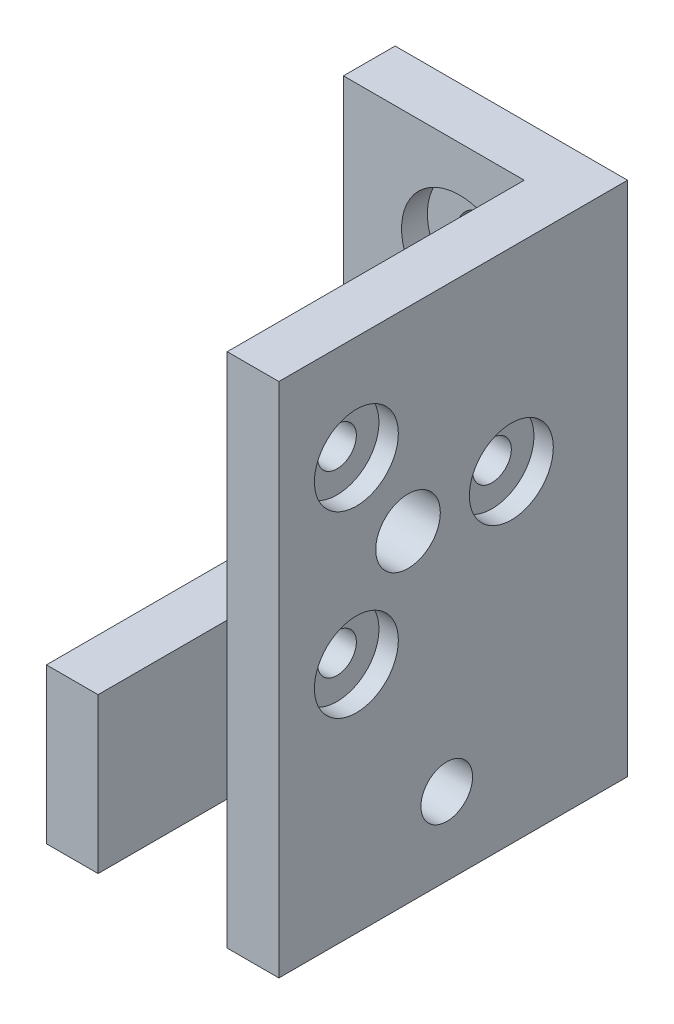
from build123d import *

# Parameters (mm, degrees)
ESQUISSE1_W                = 18
ESQUISSE1_H                = 40
BOSS_EXTRU_1_DEPTH         = 4
ESQUISSE2_W                = 4
ESQUISSE2_H                = 12
ESQUISSE2_H_2              = 40
BOSS_EXTRU_2_DEPTH         = 23
ESQUISSE4_R                = 2
ENL_V_MAT_EXTRU_1_DEPTH    = 52.507281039
ESQUISSE6_R                = 2.25
ENL_V_MAT_EXTRU_2_DEPTH    = 10
R_P_TITION_LIN_AIRE1_COUNT = 2
R_P_TITION_LIN_AIRE1_PITCH = 24
ESQUISSE8_R                = 2.5
ENL_V_MAT_EXTRU_3_DEPTH    = 10
ESQUISSE9_R                = 1.5
ENL_V_MAT_EXTRU_4_DEPTH    = 10
ESQUISSE10_R               = 3.25
ENL_V_MAT_EXTRU_5_DEPTH    = 1.5
ESQUISSE11_R               = 4.5
ENL_V_MAT_EXTRU_6_DEPTH    = 2


with BuildPart() as part:
    # Esquisse1 → Boss.-Extru.1 (new body)
    with BuildSketch(Plane.XY):
        with Locations((9, 20)):
            Rectangle(ESQUISSE1_W, ESQUISSE1_H)
    extrude(amount=BOSS_EXTRU_1_DEPTH)

    # Esquisse2 → Boss.-Extru.2 (add)
    with BuildSketch(Plane.XY.offset(4)):
        with Locations((2, 6)):
            Rectangle(ESQUISSE2_W, ESQUISSE2_H)
        with Locations((16, 20)):
            Rectangle(ESQUISSE2_W, ESQUISSE2_H_2)
    extrude(amount=BOSS_EXTRU_2_DEPTH)

    # Esquisse4 → Enl_v. mat.-Extru.1 (cut, through all)
    with BuildSketch(Plane.ZY):
        with Locations((14, 6)):
            Circle(ESQUISSE4_R)
    extrude(amount=-ENL_V_MAT_EXTRU_1_DEPTH, mode=Mode.SUBTRACT)

    # Esquisse6 → Enl_v. mat.-Extru.2 (cut)
    with BuildSketch(Plane.XY.offset(4)):
        with Locations((9, 32)):
            Circle(ESQUISSE6_R)
    enl_v_mat_extru_2 = extrude(amount=-ENL_V_MAT_EXTRU_2_DEPTH, mode=Mode.SUBTRACT)

    # R_p_tition lin_aire1: Enl_v. mat.-Extru.2 ×2
    with Locations(*[(0, -i * R_P_TITION_LIN_AIRE1_PITCH, 0) for i in range(1, R_P_TITION_LIN_AIRE1_COUNT)]):
        add(enl_v_mat_extru_2, mode=Mode.SUBTRACT)

    # Esquisse8 → Enl_v. mat.-Extru.3 (cut)
    with BuildSketch(Plane(origin=(18, 0, 0), x_dir=(0, 0, -1), z_dir=(1, 0, 0))):
        with Locations((-17, 24.964176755)):
            Circle(ESQUISSE8_R)
    extrude(amount=-ENL_V_MAT_EXTRU_3_DEPTH, mode=Mode.SUBTRACT)

    # Esquisse9 → Enl_v. mat.-Extru.4 (cut)
    with BuildSketch(Plane.ZY.offset(-14)):
        with Locations(Location((21, 31.892379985, 0), (0, 0, 270))):
            Circle(ESQUISSE9_R)
        with Locations(Location((9, 24.964176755, 0), (0, 0, 270))):
            Circle(ESQUISSE9_R)
        with Locations(Location((21, 18.035973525, 0), (0, 0, 270))):
            Circle(ESQUISSE9_R)
    extrude(amount=-ENL_V_MAT_EXTRU_4_DEPTH, mode=Mode.SUBTRACT)

    # Esquisse10 → Enl_v. mat.-Extru.5 (cut)
    with BuildSketch(Plane(origin=(18, 0, 0), x_dir=(0, 0, -1), z_dir=(1, 0, 0))):
        with Locations((-21, 31.892379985)):
            Circle(ESQUISSE10_R)
        with Locations((-9, 24.964176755)):
            Circle(ESQUISSE10_R)
        with Locations((-21, 18.035973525)):
            Circle(ESQUISSE10_R)
    extrude(amount=-ENL_V_MAT_EXTRU_5_DEPTH, mode=Mode.SUBTRACT)

    # Esquisse11 → Enl_v. mat.-Extru.6 (cut)
    with BuildSketch(Plane.XY.offset(4)):
        with Locations((9, 32)):
            Circle(ESQUISSE11_R)
        with Locations((9, 8)):
            Circle(ESQUISSE11_R)
    extrude(amount=-ENL_V_MAT_EXTRU_6_DEPTH, mode=Mode.SUBTRACT)


solid = part.part
